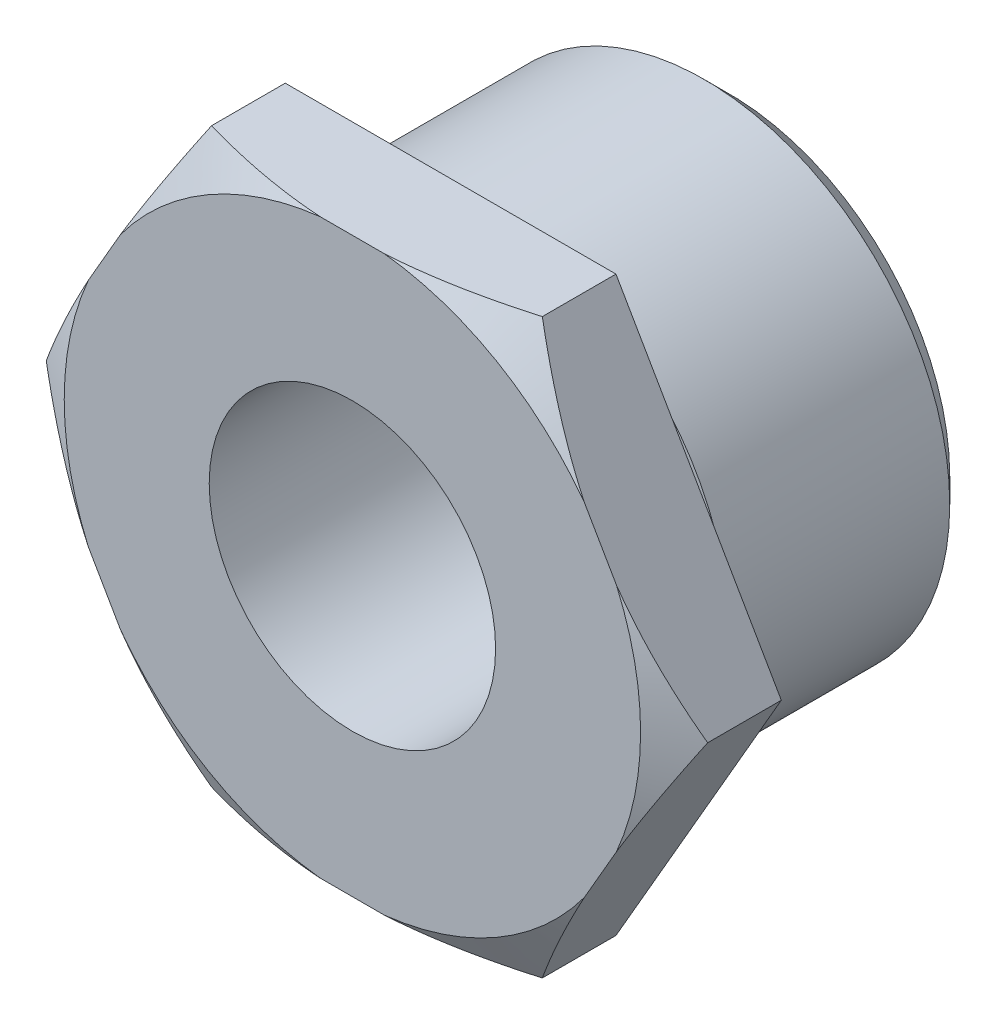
ISO-10303-21;
HEADER;
FILE_DESCRIPTION(('STEP AP214'),'2;1');
FILE_NAME('part.step','',(''),(''),'','','');
FILE_SCHEMA(('AUTOMOTIVE_DESIGN { 1 0 10303 214 1 1 1 1 }'));
ENDSEC;
DATA;
#1=APPLICATION_CONTEXT('core data for automotive mechanical design processes');
#2=APPLICATION_PROTOCOL_DEFINITION('international standard','automotive_design',2000,#1);
#3=PRODUCT_CONTEXT('',#1,'mechanical');
#4=PRODUCT('Part','Part','',(#3));
#5=PRODUCT_RELATED_PRODUCT_CATEGORY('part','',(#4));
#6=PRODUCT_DEFINITION_FORMATION('','',#4);
#7=PRODUCT_DEFINITION_CONTEXT('part definition',#1,'design');
#8=PRODUCT_DEFINITION('design','',#6,#7);
#9=PRODUCT_DEFINITION_SHAPE('','',#8);
#10=(LENGTH_UNIT() NAMED_UNIT(*) SI_UNIT(.MILLI.,.METRE.));
#11=(NAMED_UNIT(*) PLANE_ANGLE_UNIT() SI_UNIT($,.RADIAN.));
#12=(NAMED_UNIT(*) SI_UNIT($,.STERADIAN.) SOLID_ANGLE_UNIT());
#13=UNCERTAINTY_MEASURE_WITH_UNIT(LENGTH_MEASURE(1.E-05),#10,'distance_accuracy_value','');
#14=(GEOMETRIC_REPRESENTATION_CONTEXT(3) GLOBAL_UNCERTAINTY_ASSIGNED_CONTEXT((#13)) GLOBAL_UNIT_ASSIGNED_CONTEXT((#10,
#11,#12)) REPRESENTATION_CONTEXT('',''));
#15=CARTESIAN_POINT('',(0.,0.,0.));
#16=DIRECTION('',(0.,0.,1.));
#17=DIRECTION('',(1.,0.,0.));
#18=AXIS2_PLACEMENT_3D('',#15,#16,#17);
#19=CARTESIAN_POINT('',(-10.1036297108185,17.5,0.));
#20=DIRECTION('',(0.,0.,-1.));
#21=DIRECTION('',(-1.,0.,0.));
#22=AXIS2_PLACEMENT_3D('',#19,#20,#21);
#23=PLANE('',#22);
#24=DIRECTION('',(-0.5,-0.866025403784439,0.));
#25=VECTOR('',#24,1.);
#26=CARTESIAN_POINT('',(-10.1036297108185,17.5,0.));
#27=LINE('',#26,#25);
#28=CARTESIAN_POINT('',(-10.1036297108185,17.5,0.));
#29=VERTEX_POINT('',#28);
#30=CARTESIAN_POINT('',(-20.2072594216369,0.,0.));
#31=VERTEX_POINT('',#30);
#32=EDGE_CURVE('E123',#29,#31,#27,.T.);
#33=ORIENTED_EDGE('',*,*,#32,.F.);
#34=DIRECTION('',(-1.,0.,0.));
#35=VECTOR('',#34,1.);
#36=CARTESIAN_POINT('',(10.1036297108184,17.5,0.));
#37=LINE('',#36,#35);
#38=CARTESIAN_POINT('',(10.1036297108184,17.5,0.));
#39=VERTEX_POINT('',#38);
#40=EDGE_CURVE('E167',#39,#29,#37,.T.);
#41=ORIENTED_EDGE('',*,*,#40,.F.);
#42=DIRECTION('',(-0.5,0.866025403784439,0.));
#43=VECTOR('',#42,1.);
#44=CARTESIAN_POINT('',(20.2072594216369,0.,0.));
#45=LINE('',#44,#43);
#46=CARTESIAN_POINT('',(20.2072594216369,0.,0.));
#47=VERTEX_POINT('',#46);
#48=EDGE_CURVE('E170',#47,#39,#45,.T.);
#49=ORIENTED_EDGE('',*,*,#48,.F.);
#50=DIRECTION('',(0.5,0.866025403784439,0.));
#51=VECTOR('',#50,1.);
#52=CARTESIAN_POINT('',(10.1036297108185,-17.5,0.));
#53=LINE('',#52,#51);
#54=CARTESIAN_POINT('',(10.1036297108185,-17.5,0.));
#55=VERTEX_POINT('',#54);
#56=EDGE_CURVE('E173',#55,#47,#53,.T.);
#57=ORIENTED_EDGE('',*,*,#56,.F.);
#58=DIRECTION('',(1.,0.,0.));
#59=VECTOR('',#58,1.);
#60=CARTESIAN_POINT('',(-10.1036297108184,-17.5,0.));
#61=LINE('',#60,#59);
#62=CARTESIAN_POINT('',(-10.1036297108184,-17.5,0.));
#63=VERTEX_POINT('',#62);
#64=EDGE_CURVE('E176',#63,#55,#61,.T.);
#65=ORIENTED_EDGE('',*,*,#64,.F.);
#66=DIRECTION('',(0.5,-0.866025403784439,0.));
#67=VECTOR('',#66,1.);
#68=CARTESIAN_POINT('',(-20.2072594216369,0.,0.));
#69=LINE('',#68,#67);
#70=EDGE_CURVE('E179',#31,#63,#69,.T.);
#71=ORIENTED_EDGE('',*,*,#70,.F.);
#72=EDGE_LOOP('',(#33,#41,#49,#57,#65,#71));
#73=FACE_BOUND('',#72,.T.);
#74=CARTESIAN_POINT('',(0.,0.,0.));
#75=DIRECTION('',(0.,0.,1.));
#76=DIRECTION('',(1.,0.,0.));
#77=AXIS2_PLACEMENT_3D('',#74,#75,#76);
#78=CIRCLE('',#77,13.5);
#79=CARTESIAN_POINT('',(13.5,0.,0.));
#80=VERTEX_POINT('',#79);
#81=EDGE_CURVE('E255',#80,#80,#78,.T.);
#82=ORIENTED_EDGE('',*,*,#81,.T.);
#83=EDGE_LOOP('',(#82));
#84=FACE_BOUND('',#83,.T.);
#85=ADVANCED_FACE('F24',(#73,#84),#23,.T.);
#86=CARTESIAN_POINT('',(-10.1036297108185,17.5,6.));
#87=DIRECTION('',(0.866025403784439,-0.5,0.));
#88=DIRECTION('',(0.5,0.866025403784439,0.));
#89=AXIS2_PLACEMENT_3D('',#86,#87,#88);
#90=PLANE('',#89);
#91=DIRECTION('',(0.,0.,-1.));
#92=VECTOR('',#91,1.);
#93=CARTESIAN_POINT('',(-20.2072594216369,0.,6.));
#94=LINE('',#93,#92);
#95=CARTESIAN_POINT('',(-20.2072594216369,0.,4.5));
#96=VERTEX_POINT('',#95);
#97=EDGE_CURVE('E131',#96,#31,#94,.T.);
#98=ORIENTED_EDGE('',*,*,#97,.F.);
#99=CARTESIAN_POINT('',(-20.58633056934,-0.656570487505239,4.27509975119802));
#100=CARTESIAN_POINT('',(-20.3531796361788,-0.252741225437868,4.41705331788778));
#101=CARTESIAN_POINT('',(-20.1190873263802,0.152718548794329,4.55302058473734));
#102=CARTESIAN_POINT('',(-19.6488932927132,0.967118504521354,4.81115721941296));
#103=CARTESIAN_POINT('',(-19.4127906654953,1.37606025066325,4.93331998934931));
#104=CARTESIAN_POINT('',(-18.9379290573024,2.19854468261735,5.1622414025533));
#105=CARTESIAN_POINT('',(-18.6991640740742,2.61209776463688,5.26895062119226));
#106=CARTESIAN_POINT('',(-18.2198521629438,3.44229034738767,5.46446469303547));
#107=CARTESIAN_POINT('',(-17.979305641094,3.85892914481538,5.5532735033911));
#108=CARTESIAN_POINT('',(-17.4978479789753,4.69283827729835,5.71064164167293));
#109=CARTESIAN_POINT('',(-17.2569453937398,5.11009379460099,5.77930490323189));
#110=CARTESIAN_POINT('',(-16.7738311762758,5.94687216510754,5.89529137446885));
#111=CARTESIAN_POINT('',(-16.531619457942,6.36639516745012,5.94261316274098));
#112=CARTESIAN_POINT('',(-16.0467259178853,7.20625541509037,6.01454592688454));
#113=CARTESIAN_POINT('',(-15.8040453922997,7.62659041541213,6.03919172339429));
#114=CARTESIAN_POINT('',(-15.3184039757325,8.46774602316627,6.06516470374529));
#115=CARTESIAN_POINT('',(-15.07544315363,8.88856651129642,6.0664967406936));
#116=CARTESIAN_POINT('',(-14.7780435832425,9.40367767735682,6.05384021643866));
#117=CARTESIAN_POINT('',(-14.7234569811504,9.49822444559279,6.05092706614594));
#118=CARTESIAN_POINT('',(-14.6143029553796,9.68728476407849,6.04392870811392));
#119=CARTESIAN_POINT('',(-14.5597355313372,9.78179831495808,6.03984352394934));
#120=CARTESIAN_POINT('',(-14.3960829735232,10.0652528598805,6.02583886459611));
#121=CARTESIAN_POINT('',(-14.2870348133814,10.2541298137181,6.01416973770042));
#122=CARTESIAN_POINT('',(-14.0056541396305,10.7414954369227,5.97809935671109));
#123=CARTESIAN_POINT('',(-13.8334297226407,11.039796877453,5.95024064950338));
#124=CARTESIAN_POINT('',(-13.4895162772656,11.6354724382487,5.88340799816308));
#125=CARTESIAN_POINT('',(-13.3178272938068,11.932846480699,5.84443314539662));
#126=CARTESIAN_POINT('',(-12.8036745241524,12.8233852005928,5.71156705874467));
#127=CARTESIAN_POINT('',(-12.4622163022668,13.4148081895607,5.60174649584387));
#128=CARTESIAN_POINT('',(-11.7822674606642,14.5925141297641,5.34463526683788));
#129=CARTESIAN_POINT('',(-11.4437835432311,15.1787854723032,5.1972752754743));
#130=CARTESIAN_POINT('',(-10.7707318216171,16.3445452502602,4.87095028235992));
#131=CARTESIAN_POINT('',(-10.4361634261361,16.9240347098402,4.69199012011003));
#132=CARTESIAN_POINT('',(-9.87797967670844,17.8908373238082,4.36971974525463));
#133=CARTESIAN_POINT('',(-9.65332733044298,18.2799466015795,4.23348593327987));
#134=CARTESIAN_POINT('',(-9.20629672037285,19.0542263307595,3.95082475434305));
#135=CARTESIAN_POINT('',(-8.98391395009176,19.4394045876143,3.80442594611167));
#136=CARTESIAN_POINT('',(-8.76231373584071,19.8232274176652,3.65349377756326));
#137=B_SPLINE_CURVE_WITH_KNOTS('',3,(#99,#100,#101,#102,#103,#104,#105,#106,#107,#108,#109,#110,
#111,#112,#113,#114,#115,#116,#117,#118,#119,#120,#121,#122,#123,#124,#125,#126,#127,#128,#129,
#130,#131,#132,#133,#134,#135,#136),.UNSPECIFIED.,.F.,.F.,(4,2,2,2,2,2,2,2,2,2,2,2,2,2,2,2,2,2,
4),(0.,1.46233657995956,2.92536915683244,4.39298219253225,5.86027043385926,7.31984996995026,
8.77952670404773,10.2369582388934,11.6940863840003,12.021720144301,12.3493473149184,
13.0045252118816,14.0410409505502,15.0776414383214,17.1513909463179,19.2289982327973,
21.30628761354,22.71467992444,24.1192640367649),.UNSPECIFIED.);
#138=CARTESIAN_POINT('',(-16.1343895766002,7.05441750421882,6.));
#139=VERTEX_POINT('',#138);
#140=EDGE_CURVE('E114',#96,#139,#137,.T.);
#141=ORIENTED_EDGE('',*,*,#140,.T.);
#142=DIRECTION('',(-0.5,-0.866025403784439,0.));
#143=VECTOR('',#142,1.);
#144=CARTESIAN_POINT('',(-10.1036297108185,17.5,6.));
#145=LINE('',#144,#143);
#146=CARTESIAN_POINT('',(-14.1764995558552,10.4455824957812,6.));
#147=VERTEX_POINT('',#146);
#148=EDGE_CURVE('E165',#147,#139,#145,.T.);
#149=ORIENTED_EDGE('',*,*,#148,.F.);
#150=CARTESIAN_POINT('',(-10.1036297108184,17.5,4.5));
#151=VERTEX_POINT('',#150);
#152=EDGE_CURVE('E125',#147,#151,#137,.T.);
#153=ORIENTED_EDGE('',*,*,#152,.T.);
#154=DIRECTION('',(0.,0.,-1.));
#155=VECTOR('',#154,1.);
#156=CARTESIAN_POINT('',(-10.1036297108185,17.5,6.));
#157=LINE('',#156,#155);
#158=EDGE_CURVE('E150',#151,#29,#157,.T.);
#159=ORIENTED_EDGE('',*,*,#158,.T.);
#160=ORIENTED_EDGE('',*,*,#32,.T.);
#161=EDGE_LOOP('',(#98,#141,#149,#153,#159,#160));
#162=FACE_BOUND('',#161,.T.);
#163=ADVANCED_FACE('F26',(#162),#90,.F.);
#164=CARTESIAN_POINT('',(-20.2072594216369,0.,6.));
#165=DIRECTION('',(0.866025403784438,0.5,0.));
#166=DIRECTION('',(-0.5,0.866025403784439,0.));
#167=AXIS2_PLACEMENT_3D('',#164,#165,#166);
#168=PLANE('',#167);
#169=DIRECTION('',(0.,0.,-1.));
#170=VECTOR('',#169,1.);
#171=CARTESIAN_POINT('',(-10.1036297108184,-17.5,6.));
#172=LINE('',#171,#170);
#173=CARTESIAN_POINT('',(-10.1036297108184,-17.5,4.5));
#174=VERTEX_POINT('',#173);
#175=EDGE_CURVE('E140',#174,#63,#172,.T.);
#176=ORIENTED_EDGE('',*,*,#175,.F.);
#177=CARTESIAN_POINT('',(-8.7623137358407,-19.8232274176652,3.65349377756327));
#178=CARTESIAN_POINT('',(-9.00714381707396,-19.399169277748,3.82023789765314));
#179=CARTESIAN_POINT('',(-9.25294160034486,-18.973435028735,3.98147021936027));
#180=CARTESIAN_POINT('',(-9.7466647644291,-18.1182814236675,4.29096488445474));
#181=CARTESIAN_POINT('',(-9.99459089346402,-17.6888607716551,4.43922244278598));
#182=CARTESIAN_POINT('',(-10.4935779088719,-16.8245899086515,4.72125796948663));
#183=CARTESIAN_POINT('',(-10.7446473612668,-16.3897248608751,4.85497573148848));
#184=CARTESIAN_POINT('',(-11.2489357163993,-15.5162718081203,5.10493348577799));
#185=CARTESIAN_POINT('',(-11.5021543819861,-15.0776842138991,5.22117538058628));
#186=CARTESIAN_POINT('',(-12.0096853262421,-14.1986148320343,5.43337963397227));
#187=CARTESIAN_POINT('',(-12.2639894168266,-13.7581472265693,5.52941976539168));
#188=CARTESIAN_POINT('',(-12.7744660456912,-12.8739757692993,5.69945726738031));
#189=CARTESIAN_POINT('',(-13.0306386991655,-12.4302717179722,5.77345326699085));
#190=CARTESIAN_POINT('',(-13.5439885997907,-11.5411236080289,5.89720349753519));
#191=CARTESIAN_POINT('',(-13.8011632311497,-11.0956840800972,5.94700084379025));
#192=CARTESIAN_POINT('',(-14.3163997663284,-10.2032682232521,6.02098022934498));
#193=CARTESIAN_POINT('',(-14.5744614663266,-9.75629224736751,6.04516780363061));
#194=CARTESIAN_POINT('',(-14.9410350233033,-9.12136822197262,6.06078026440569));
#195=CARTESIAN_POINT('',(-15.0494522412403,-8.93358409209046,6.06307148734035));
#196=CARTESIAN_POINT('',(-15.2662887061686,-8.55801231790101,6.06300164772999));
#197=CARTESIAN_POINT('',(-15.3747079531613,-8.37022467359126,6.06064050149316));
#198=CARTESIAN_POINT('',(-15.699838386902,-7.80708224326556,6.04658789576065));
#199=CARTESIAN_POINT('',(-15.9164850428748,-7.43183922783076,6.02792993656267));
#200=CARTESIAN_POINT('',(-16.3053276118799,-6.75834414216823,5.97809030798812));
#201=CARTESIAN_POINT('',(-16.4776332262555,-6.45990206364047,5.95021335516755));
#202=CARTESIAN_POINT('',(-16.8217073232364,-5.86394824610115,5.88333650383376));
#203=CARTESIAN_POINT('',(-16.9934757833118,-5.5664365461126,5.84433614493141));
#204=CARTESIAN_POINT('',(-17.5078584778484,-4.67549958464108,5.71138071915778));
#205=CARTESIAN_POINT('',(-17.8494648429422,-4.08382000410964,5.60148267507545));
#206=CARTESIAN_POINT('',(-18.5294060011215,-2.90612737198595,5.34430282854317));
#207=CARTESIAN_POINT('',(-18.8677372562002,-2.32012044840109,5.19698445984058));
#208=CARTESIAN_POINT('',(-19.5404822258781,-1.15489198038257,4.8707772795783));
#209=CARTESIAN_POINT('',(-19.8748966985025,-0.575669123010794,4.69189468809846));
#210=CARTESIAN_POINT('',(-20.2706964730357,0.109876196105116,4.46337365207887));
#211=CARTESIAN_POINT('',(-20.3339478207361,0.219430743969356,4.42633957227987));
#212=CARTESIAN_POINT('',(-20.460264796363,0.438218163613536,4.35138377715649));
#213=CARTESIAN_POINT('',(-20.5233305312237,0.547451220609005,4.31346278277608));
#214=CARTESIAN_POINT('',(-20.58633056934,0.656570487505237,4.27509975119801));
#215=B_SPLINE_CURVE_WITH_KNOTS('',3,(#177,#178,#179,#180,#181,#182,#183,#184,#185,#186,#187,
#188,#189,#190,#191,#192,#193,#194,#195,#196,#197,#198,#199,#200,#201,#202,#203,#204,#205,#206,
#207,#208,#209,#210,#211,#212,#213,#214),.UNSPECIFIED.,.F.,.F.,(4,2,2,2,2,2,2,2,2,2,2,2,2,2,2,2,
2,2,4),(0.,1.55186666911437,3.10430327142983,4.66294128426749,6.22140949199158,7.77376341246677,
9.32621385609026,10.8758880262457,12.4252272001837,13.075726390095,13.7262372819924,
15.0268826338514,16.063915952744,17.1009921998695,19.1756560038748,21.2523549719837,
23.3286451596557,23.7240815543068,24.1192069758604),.UNSPECIFIED.);
#216=CARTESIAN_POINT('',(-14.1764995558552,-10.4455824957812,6.));
#217=VERTEX_POINT('',#216);
#218=EDGE_CURVE('E136',#174,#217,#215,.T.);
#219=ORIENTED_EDGE('',*,*,#218,.T.);
#220=DIRECTION('',(0.5,-0.866025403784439,0.));
#221=VECTOR('',#220,1.);
#222=CARTESIAN_POINT('',(-20.2072594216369,0.,6.));
#223=LINE('',#222,#221);
#224=CARTESIAN_POINT('',(-16.1343895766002,-7.05441750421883,6.));
#225=VERTEX_POINT('',#224);
#226=EDGE_CURVE('E135',#225,#217,#223,.T.);
#227=ORIENTED_EDGE('',*,*,#226,.F.);
#228=EDGE_CURVE('E117',#225,#96,#215,.T.);
#229=ORIENTED_EDGE('',*,*,#228,.T.);
#230=ORIENTED_EDGE('',*,*,#97,.T.);
#231=ORIENTED_EDGE('',*,*,#70,.T.);
#232=EDGE_LOOP('',(#176,#219,#227,#229,#230,#231));
#233=FACE_BOUND('',#232,.T.);
#234=ADVANCED_FACE('F129',(#233),#168,.F.);
#235=CARTESIAN_POINT('',(-10.1036297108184,-17.5,6.));
#236=DIRECTION('',(0.,1.,0.));
#237=DIRECTION('',(-1.,0.,0.));
#238=AXIS2_PLACEMENT_3D('',#235,#236,#237);
#239=PLANE('',#238);
#240=DIRECTION('',(0.,0.,-1.));
#241=VECTOR('',#240,1.);
#242=CARTESIAN_POINT('',(10.1036297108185,-17.5,6.));
#243=LINE('',#242,#241);
#244=CARTESIAN_POINT('',(10.1036297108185,-17.5,4.5));
#245=VERTEX_POINT('',#244);
#246=EDGE_CURVE('E142',#245,#55,#243,.T.);
#247=ORIENTED_EDGE('',*,*,#246,.F.);
#248=CARTESIAN_POINT('',(-26.8050592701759,-17.5,-2.3154075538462));
#249=CARTESIAN_POINT('',(-26.4208649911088,-17.5,-2.12967562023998));
#250=CARTESIAN_POINT('',(-26.0362065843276,-17.5,-1.94490422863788));
#251=CARTESIAN_POINT('',(-25.2658634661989,-17.5,-1.57750298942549));
#252=CARTESIAN_POINT('',(-24.8801787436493,-17.5,-1.39487316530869));
#253=CARTESIAN_POINT('',(-23.7213252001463,-17.5,-0.850473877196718));
#254=CARTESIAN_POINT('',(-22.9464817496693,-17.5,-0.492255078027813));
#255=CARTESIAN_POINT('',(-21.3870139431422,-17.5,0.214451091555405));
#256=CARTESIAN_POINT('',(-20.6023589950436,-17.5,0.562871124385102));
#257=CARTESIAN_POINT('',(-19.0266039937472,-17.5,1.24476425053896));
#258=CARTESIAN_POINT('',(-18.2355042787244,-17.5,1.57823812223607));
#259=CARTESIAN_POINT('',(-16.6357403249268,-17.5,2.23023092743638));
#260=CARTESIAN_POINT('',(-15.8269797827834,-17.5,2.54851480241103));
#261=CARTESIAN_POINT('',(-14.1999167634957,-17.5,3.16017758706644));
#262=CARTESIAN_POINT('',(-13.3816132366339,-17.5,3.45355372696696));
#263=CARTESIAN_POINT('',(-11.735867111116,-17.5,4.00752051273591));
#264=CARTESIAN_POINT('',(-10.9084481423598,-17.5,4.26818078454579));
#265=CARTESIAN_POINT('',(-9.24176728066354,-17.5,4.74826895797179));
#266=CARTESIAN_POINT('',(-8.40250922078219,-17.5,4.96770988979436));
#267=CARTESIAN_POINT('',(-7.1345838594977,-17.5,5.25792756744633));
#268=CARTESIAN_POINT('',(-6.7103476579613,-17.5,5.34819070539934));
#269=CARTESIAN_POINT('',(-5.85904966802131,-17.5,5.51431164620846));
#270=CARTESIAN_POINT('',(-5.43198794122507,-17.5,5.59016976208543));
#271=CARTESIAN_POINT('',(-4.5753164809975,-17.5,5.72613760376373));
#272=CARTESIAN_POINT('',(-4.14570654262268,-17.5,5.78624604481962));
#273=CARTESIAN_POINT('',(-3.28445659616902,-17.5,5.88950333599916));
#274=CARTESIAN_POINT('',(-2.85281667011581,-17.5,5.93265286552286));
#275=CARTESIAN_POINT('',(-1.99085543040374,-17.5,6.00083445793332));
#276=CARTESIAN_POINT('',(-1.56054313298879,-17.5,6.02597976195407));
#277=CARTESIAN_POINT('',(-0.69924074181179,-17.5,6.05801923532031));
#278=CARTESIAN_POINT('',(-0.268250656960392,-17.5,6.06491364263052));
#279=CARTESIAN_POINT('',(0.593511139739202,-17.5,6.06028771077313));
#280=CARTESIAN_POINT('',(1.02428287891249,-17.5,6.04877255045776));
#281=CARTESIAN_POINT('',(1.88496527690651,-17.5,6.00761389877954));
#282=CARTESIAN_POINT('',(2.31487589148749,-17.5,5.97796949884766));
#283=CARTESIAN_POINT('',(3.35656616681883,-17.5,5.88479435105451));
#284=CARTESIAN_POINT('',(3.96754806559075,-17.5,5.81219590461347));
#285=CARTESIAN_POINT('',(5.18483582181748,-17.5,5.63441013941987));
#286=CARTESIAN_POINT('',(5.79114035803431,-17.5,5.52921393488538));
#287=CARTESIAN_POINT('',(6.99857131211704,-17.5,5.28996340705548));
#288=CARTESIAN_POINT('',(7.599692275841,-17.5,5.15588181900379));
#289=CARTESIAN_POINT('',(8.79575221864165,-17.5,4.86295248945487));
#290=CARTESIAN_POINT('',(9.39069177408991,-17.5,4.70410707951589));
#291=CARTESIAN_POINT('',(10.5890545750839,-17.5,4.36129337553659));
#292=CARTESIAN_POINT('',(11.1923278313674,-17.5,4.17680430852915));
#293=CARTESIAN_POINT('',(12.3924967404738,-17.5,3.78958454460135));
#294=CARTESIAN_POINT('',(12.9893964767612,-17.5,3.58686642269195));
#295=CARTESIAN_POINT('',(14.1744289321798,-17.5,3.16735170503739));
#296=CARTESIAN_POINT('',(14.7625920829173,-17.5,2.950640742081));
#297=CARTESIAN_POINT('',(15.6413484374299,-17.5,2.61610280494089));
#298=CARTESIAN_POINT('',(15.9337483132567,-17.5,2.50298623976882));
#299=CARTESIAN_POINT('',(16.5174103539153,-17.5,2.27387357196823));
#300=CARTESIAN_POINT('',(16.8086725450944,-17.5,2.15787753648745));
#301=CARTESIAN_POINT('',(17.0994067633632,-17.5,2.04057129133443));
#302=B_SPLINE_CURVE_WITH_KNOTS('',3,(#248,#249,#250,#251,#252,#253,#254,#255,#256,#257,#258,
#259,#260,#261,#262,#263,#264,#265,#266,#267,#268,#269,#270,#271,#272,#273,#274,#275,#276,#277,
#278,#279,#280,#281,#282,#283,#284,#285,#286,#287,#288,#289,#290,#291,#292,#293,#294,#295,#296,
#297,#298,#299,#300,#301),.UNSPECIFIED.,.F.,.F.,(4,2,2,2,2,2,2,2,2,2,2,2,2,2,2,2,2,2,2,2,2,2,2,
2,2,2,4),(0.,1.28019841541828,2.56041086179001,5.12125163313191,7.69673179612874,
10.2720776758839,12.8791738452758,15.4865595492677,18.0882985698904,20.68921374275,
21.9902056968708,23.2911693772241,24.5922391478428,25.8932567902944,27.1860177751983,
28.4787619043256,29.7711424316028,31.0635877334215,32.9083997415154,34.7537150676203,
36.6007798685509,38.4476708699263,40.3398756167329,42.230784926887,44.111054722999,
45.051594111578,45.9921115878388),.UNSPECIFIED.);
#303=CARTESIAN_POINT('',(1.95789002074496,-17.5,6.));
#304=VERTEX_POINT('',#303);
#305=EDGE_CURVE('E187',#245,#304,#302,.F.);
#306=ORIENTED_EDGE('',*,*,#305,.T.);
#307=DIRECTION('',(1.,0.,0.));
#308=VECTOR('',#307,1.);
#309=CARTESIAN_POINT('',(-10.1036297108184,-17.5,6.));
#310=LINE('',#309,#308);
#311=CARTESIAN_POINT('',(-1.95789002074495,-17.5,6.));
#312=VERTEX_POINT('',#311);
#313=EDGE_CURVE('E161',#312,#304,#310,.T.);
#314=ORIENTED_EDGE('',*,*,#313,.F.);
#315=EDGE_CURVE('E186',#312,#174,#302,.F.);
#316=ORIENTED_EDGE('',*,*,#315,.T.);
#317=ORIENTED_EDGE('',*,*,#175,.T.);
#318=ORIENTED_EDGE('',*,*,#64,.T.);
#319=EDGE_LOOP('',(#247,#306,#314,#316,#317,#318));
#320=FACE_BOUND('',#319,.T.);
#321=ADVANCED_FACE('F236',(#320),#239,.F.);
#322=CARTESIAN_POINT('',(10.1036297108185,-17.5,6.));
#323=DIRECTION('',(-0.866025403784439,0.5,0.));
#324=DIRECTION('',(-0.5,-0.866025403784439,0.));
#325=AXIS2_PLACEMENT_3D('',#322,#323,#324);
#326=PLANE('',#325);
#327=DIRECTION('',(0.,0.,-1.));
#328=VECTOR('',#327,1.);
#329=CARTESIAN_POINT('',(20.2072594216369,0.,6.));
#330=LINE('',#329,#328);
#331=CARTESIAN_POINT('',(20.2072594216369,0.,4.5));
#332=VERTEX_POINT('',#331);
#333=EDGE_CURVE('E146',#332,#47,#330,.T.);
#334=ORIENTED_EDGE('',*,*,#333,.F.);
#335=CARTESIAN_POINT('',(20.58633056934,0.656570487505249,4.27509975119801));
#336=CARTESIAN_POINT('',(20.3531796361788,0.252741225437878,4.41705331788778));
#337=CARTESIAN_POINT('',(20.1190873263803,-0.152718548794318,4.55302058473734));
#338=CARTESIAN_POINT('',(19.6488932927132,-0.967118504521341,4.81115721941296));
#339=CARTESIAN_POINT('',(19.4127906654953,-1.37606025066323,4.93331998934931));
#340=CARTESIAN_POINT('',(18.9379290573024,-2.19854468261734,5.1622414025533));
#341=CARTESIAN_POINT('',(18.6991640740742,-2.61209776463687,5.26895062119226));
#342=CARTESIAN_POINT('',(18.2198521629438,-3.44229034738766,5.46446469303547));
#343=CARTESIAN_POINT('',(17.9793056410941,-3.85892914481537,5.5532735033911));
#344=CARTESIAN_POINT('',(17.4978479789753,-4.69283827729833,5.71064164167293));
#345=CARTESIAN_POINT('',(17.2569453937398,-5.11009379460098,5.77930490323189));
#346=CARTESIAN_POINT('',(16.7738311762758,-5.94687216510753,5.89529137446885));
#347=CARTESIAN_POINT('',(16.5316194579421,-6.3663951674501,5.94261316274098));
#348=CARTESIAN_POINT('',(16.0467259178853,-7.20625541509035,6.01454592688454));
#349=CARTESIAN_POINT('',(15.8040453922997,-7.62659041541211,6.03919172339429));
#350=CARTESIAN_POINT('',(15.3184039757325,-8.46774602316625,6.06516470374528));
#351=CARTESIAN_POINT('',(15.07544315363,-8.8885665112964,6.06649674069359));
#352=CARTESIAN_POINT('',(14.7780435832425,-9.40367767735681,6.05384021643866));
#353=CARTESIAN_POINT('',(14.7234569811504,-9.49822444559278,6.05092706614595));
#354=CARTESIAN_POINT('',(14.6143029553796,-9.68728476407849,6.04392870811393));
#355=CARTESIAN_POINT('',(14.5597355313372,-9.78179831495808,6.03984352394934));
#356=CARTESIAN_POINT('',(14.3960829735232,-10.0652528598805,6.02583886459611));
#357=CARTESIAN_POINT('',(14.2870348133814,-10.2541298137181,6.01416973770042));
#358=CARTESIAN_POINT('',(14.0056541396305,-10.7414954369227,5.9780993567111));
#359=CARTESIAN_POINT('',(13.8334297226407,-11.039796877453,5.95024064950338));
#360=CARTESIAN_POINT('',(13.4895162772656,-11.6354724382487,5.88340799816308));
#361=CARTESIAN_POINT('',(13.3178272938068,-11.932846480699,5.84443314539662));
#362=CARTESIAN_POINT('',(12.8036745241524,-12.8233852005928,5.71156705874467));
#363=CARTESIAN_POINT('',(12.4622163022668,-13.4148081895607,5.60174649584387));
#364=CARTESIAN_POINT('',(11.7822674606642,-14.5925141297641,5.34463526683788));
#365=CARTESIAN_POINT('',(11.4437835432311,-15.1787854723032,5.1972752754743));
#366=CARTESIAN_POINT('',(10.7707318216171,-16.3445452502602,4.87095028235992));
#367=CARTESIAN_POINT('',(10.4361634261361,-16.9240347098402,4.69199012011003));
#368=CARTESIAN_POINT('',(9.87797967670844,-17.8908373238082,4.36971974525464));
#369=CARTESIAN_POINT('',(9.65332733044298,-18.2799466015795,4.23348593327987));
#370=CARTESIAN_POINT('',(9.20629672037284,-19.0542263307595,3.95082475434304));
#371=CARTESIAN_POINT('',(8.98391395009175,-19.4394045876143,3.80442594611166));
#372=CARTESIAN_POINT('',(8.7623137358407,-19.8232274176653,3.65349377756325));
#373=B_SPLINE_CURVE_WITH_KNOTS('',3,(#335,#336,#337,#338,#339,#340,#341,#342,#343,#344,#345,
#346,#347,#348,#349,#350,#351,#352,#353,#354,#355,#356,#357,#358,#359,#360,#361,#362,#363,#364,
#365,#366,#367,#368,#369,#370,#371,#372),.UNSPECIFIED.,.F.,.F.,(4,2,2,2,2,2,2,2,2,2,2,2,2,2,2,2,
2,2,4),(0.,1.46233657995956,2.92536915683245,4.39298219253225,5.86027043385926,7.31984996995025,
8.77952670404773,10.2369582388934,11.6940863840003,12.021720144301,12.3493473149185,
13.0045252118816,14.0410409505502,15.0776414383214,17.1513909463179,19.2289982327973,
21.30628761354,22.71467992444,24.1192640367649),.UNSPECIFIED.);
#374=CARTESIAN_POINT('',(16.1343895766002,-7.0544175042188,6.));
#375=VERTEX_POINT('',#374);
#376=EDGE_CURVE('E225',#332,#375,#373,.T.);
#377=ORIENTED_EDGE('',*,*,#376,.T.);
#378=DIRECTION('',(0.5,0.866025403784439,0.));
#379=VECTOR('',#378,1.);
#380=CARTESIAN_POINT('',(10.1036297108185,-17.5,6.));
#381=LINE('',#380,#379);
#382=CARTESIAN_POINT('',(14.1764995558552,-10.4455824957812,6.));
#383=VERTEX_POINT('',#382);
#384=EDGE_CURVE('E158',#383,#375,#381,.T.);
#385=ORIENTED_EDGE('',*,*,#384,.F.);
#386=EDGE_CURVE('E231',#383,#245,#373,.T.);
#387=ORIENTED_EDGE('',*,*,#386,.T.);
#388=ORIENTED_EDGE('',*,*,#246,.T.);
#389=ORIENTED_EDGE('',*,*,#56,.T.);
#390=EDGE_LOOP('',(#334,#377,#385,#387,#388,#389));
#391=FACE_BOUND('',#390,.T.);
#392=ADVANCED_FACE('F232',(#391),#326,.F.);
#393=CARTESIAN_POINT('',(20.2072594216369,0.,6.));
#394=DIRECTION('',(-0.866025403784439,-0.5,0.));
#395=DIRECTION('',(0.5,-0.866025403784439,0.));
#396=AXIS2_PLACEMENT_3D('',#393,#394,#395);
#397=PLANE('',#396);
#398=DIRECTION('',(0.,0.,-1.));
#399=VECTOR('',#398,1.);
#400=CARTESIAN_POINT('',(10.1036297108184,17.5,6.));
#401=LINE('',#400,#399);
#402=CARTESIAN_POINT('',(10.1036297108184,17.5,4.5));
#403=VERTEX_POINT('',#402);
#404=EDGE_CURVE('E148',#403,#39,#401,.T.);
#405=ORIENTED_EDGE('',*,*,#404,.F.);
#406=CARTESIAN_POINT('',(8.7623137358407,19.8232274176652,3.65349377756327));
#407=CARTESIAN_POINT('',(9.00714381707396,19.399169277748,3.82023789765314));
#408=CARTESIAN_POINT('',(9.25294160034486,18.973435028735,3.98147021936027));
#409=CARTESIAN_POINT('',(9.7466647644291,18.1182814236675,4.29096488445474));
#410=CARTESIAN_POINT('',(9.99459089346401,17.6888607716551,4.43922244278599));
#411=CARTESIAN_POINT('',(10.4935779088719,16.8245899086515,4.72125796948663));
#412=CARTESIAN_POINT('',(10.7446473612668,16.3897248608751,4.85497573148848));
#413=CARTESIAN_POINT('',(11.2489357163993,15.5162718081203,5.10493348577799));
#414=CARTESIAN_POINT('',(11.5021543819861,15.0776842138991,5.22117538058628));
#415=CARTESIAN_POINT('',(12.0096853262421,14.1986148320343,5.43337963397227));
#416=CARTESIAN_POINT('',(12.2639894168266,13.7581472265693,5.52941976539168));
#417=CARTESIAN_POINT('',(12.7744660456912,12.8739757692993,5.69945726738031));
#418=CARTESIAN_POINT('',(13.0306386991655,12.4302717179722,5.77345326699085));
#419=CARTESIAN_POINT('',(13.5439885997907,11.5411236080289,5.89720349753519));
#420=CARTESIAN_POINT('',(13.8011632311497,11.0956840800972,5.94700084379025));
#421=CARTESIAN_POINT('',(14.3163997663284,10.2032682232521,6.02098022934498));
#422=CARTESIAN_POINT('',(14.5744614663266,9.75629224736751,6.04516780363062));
#423=CARTESIAN_POINT('',(14.9410350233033,9.12136822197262,6.0607802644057));
#424=CARTESIAN_POINT('',(15.0494522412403,8.93358409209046,6.06307148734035));
#425=CARTESIAN_POINT('',(15.2662887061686,8.55801231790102,6.06300164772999));
#426=CARTESIAN_POINT('',(15.3747079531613,8.37022467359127,6.06064050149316));
#427=CARTESIAN_POINT('',(15.699838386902,7.80708224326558,6.04658789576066));
#428=CARTESIAN_POINT('',(15.9164850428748,7.43183922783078,6.02792993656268));
#429=CARTESIAN_POINT('',(16.3053276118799,6.75834414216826,5.97809030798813));
#430=CARTESIAN_POINT('',(16.4776332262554,6.4599020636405,5.95021335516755));
#431=CARTESIAN_POINT('',(16.8217073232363,5.86394824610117,5.88333650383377));
#432=CARTESIAN_POINT('',(16.9934757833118,5.56643654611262,5.84433614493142));
#433=CARTESIAN_POINT('',(17.5078584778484,4.6754995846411,5.71138071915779));
#434=CARTESIAN_POINT('',(17.8494648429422,4.08382000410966,5.60148267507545));
#435=CARTESIAN_POINT('',(18.5294060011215,2.90612737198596,5.34430282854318));
#436=CARTESIAN_POINT('',(18.8677372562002,2.3201204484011,5.19698445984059));
#437=CARTESIAN_POINT('',(19.5404822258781,1.15489198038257,4.87077727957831));
#438=CARTESIAN_POINT('',(19.8748966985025,0.575669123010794,4.69189468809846));
#439=CARTESIAN_POINT('',(20.2706964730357,-0.109876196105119,4.46337365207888));
#440=CARTESIAN_POINT('',(20.3339478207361,-0.219430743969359,4.42633957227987));
#441=CARTESIAN_POINT('',(20.4602647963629,-0.438218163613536,4.35138377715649));
#442=CARTESIAN_POINT('',(20.5233305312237,-0.547451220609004,4.31346278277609));
#443=CARTESIAN_POINT('',(20.58633056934,-0.656570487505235,4.27509975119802));
#444=B_SPLINE_CURVE_WITH_KNOTS('',3,(#406,#407,#408,#409,#410,#411,#412,#413,#414,#415,#416,
#417,#418,#419,#420,#421,#422,#423,#424,#425,#426,#427,#428,#429,#430,#431,#432,#433,#434,#435,
#436,#437,#438,#439,#440,#441,#442,#443),.UNSPECIFIED.,.F.,.F.,(4,2,2,2,2,2,2,2,2,2,2,2,2,2,2,2,
2,2,4),(0.,1.55186666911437,3.10430327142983,4.66294128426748,6.22140949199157,7.77376341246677,
9.32621385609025,10.8758880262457,12.4252272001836,13.075726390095,13.7262372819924,
15.0268826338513,16.0639159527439,17.1009921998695,19.1756560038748,21.2523549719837,
23.3286451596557,23.7240815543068,24.1192069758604),.UNSPECIFIED.);
#445=CARTESIAN_POINT('',(14.1764995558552,10.4455824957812,6.));
#446=VERTEX_POINT('',#445);
#447=EDGE_CURVE('E216',#403,#446,#444,.T.);
#448=ORIENTED_EDGE('',*,*,#447,.T.);
#449=DIRECTION('',(-0.5,0.866025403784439,0.));
#450=VECTOR('',#449,1.);
#451=CARTESIAN_POINT('',(20.2072594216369,0.,6.));
#452=LINE('',#451,#450);
#453=CARTESIAN_POINT('',(16.1343895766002,7.0544175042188,6.));
#454=VERTEX_POINT('',#453);
#455=EDGE_CURVE('E155',#454,#446,#452,.T.);
#456=ORIENTED_EDGE('',*,*,#455,.F.);
#457=EDGE_CURVE('E49',#454,#332,#444,.T.);
#458=ORIENTED_EDGE('',*,*,#457,.T.);
#459=ORIENTED_EDGE('',*,*,#333,.T.);
#460=ORIENTED_EDGE('',*,*,#48,.T.);
#461=EDGE_LOOP('',(#405,#448,#456,#458,#459,#460));
#462=FACE_BOUND('',#461,.T.);
#463=ADVANCED_FACE('F235',(#462),#397,.F.);
#464=CARTESIAN_POINT('',(10.1036297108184,17.5,6.));
#465=DIRECTION('',(0.,-1.,0.));
#466=DIRECTION('',(0.,0.,-1.));
#467=AXIS2_PLACEMENT_3D('',#464,#465,#466);
#468=PLANE('',#467);
#469=ORIENTED_EDGE('',*,*,#158,.F.);
#470=CARTESIAN_POINT('',(-26.8050592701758,17.5,-2.31540755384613));
#471=CARTESIAN_POINT('',(-26.4208649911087,17.5,-2.12967562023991));
#472=CARTESIAN_POINT('',(-26.0362065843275,17.5,-1.94490422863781));
#473=CARTESIAN_POINT('',(-25.2658634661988,17.5,-1.57750298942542));
#474=CARTESIAN_POINT('',(-24.8801787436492,17.5,-1.39487316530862));
#475=CARTESIAN_POINT('',(-23.7213252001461,17.5,-0.850473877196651));
#476=CARTESIAN_POINT('',(-22.9464817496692,17.5,-0.492255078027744));
#477=CARTESIAN_POINT('',(-21.387013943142,17.5,0.214451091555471));
#478=CARTESIAN_POINT('',(-20.6023589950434,17.5,0.562871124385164));
#479=CARTESIAN_POINT('',(-19.026603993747,17.5,1.24476425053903));
#480=CARTESIAN_POINT('',(-18.2355042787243,17.5,1.57823812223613));
#481=CARTESIAN_POINT('',(-16.6357403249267,17.5,2.23023092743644));
#482=CARTESIAN_POINT('',(-15.8269797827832,17.5,2.54851480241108));
#483=CARTESIAN_POINT('',(-14.1999167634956,17.5,3.16017758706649));
#484=CARTESIAN_POINT('',(-13.3816132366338,17.5,3.45355372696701));
#485=CARTESIAN_POINT('',(-11.7358671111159,17.5,4.00752051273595));
#486=CARTESIAN_POINT('',(-10.9084481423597,17.5,4.26818078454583));
#487=CARTESIAN_POINT('',(-9.2417672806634,17.5,4.74826895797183));
#488=CARTESIAN_POINT('',(-8.40250922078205,17.5,4.96770988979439));
#489=CARTESIAN_POINT('',(-7.13458385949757,17.5,5.25792756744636));
#490=CARTESIAN_POINT('',(-6.71034765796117,17.5,5.34819070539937));
#491=CARTESIAN_POINT('',(-5.85904966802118,17.5,5.51431164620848));
#492=CARTESIAN_POINT('',(-5.43198794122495,17.5,5.59016976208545));
#493=CARTESIAN_POINT('',(-4.57531648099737,17.5,5.72613760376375));
#494=CARTESIAN_POINT('',(-4.14570654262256,17.5,5.78624604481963));
#495=CARTESIAN_POINT('',(-3.28445659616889,17.5,5.88950333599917));
#496=CARTESIAN_POINT('',(-2.85281667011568,17.5,5.93265286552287));
#497=CARTESIAN_POINT('',(-1.99085543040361,17.5,6.00083445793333));
#498=CARTESIAN_POINT('',(-1.56054313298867,17.5,6.02597976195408));
#499=CARTESIAN_POINT('',(-0.699240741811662,17.5,6.05801923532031));
#500=CARTESIAN_POINT('',(-0.268250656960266,17.5,6.06491364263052));
#501=CARTESIAN_POINT('',(0.593511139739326,17.5,6.06028771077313));
#502=CARTESIAN_POINT('',(1.02428287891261,17.5,6.04877255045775));
#503=CARTESIAN_POINT('',(1.88496527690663,17.5,6.00761389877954));
#504=CARTESIAN_POINT('',(2.31487589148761,17.5,5.97796949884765));
#505=CARTESIAN_POINT('',(3.35656616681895,17.5,5.8847943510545));
#506=CARTESIAN_POINT('',(3.96754806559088,17.5,5.81219590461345));
#507=CARTESIAN_POINT('',(5.18483582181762,17.5,5.63441013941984));
#508=CARTESIAN_POINT('',(5.79114035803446,17.5,5.52921393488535));
#509=CARTESIAN_POINT('',(6.99857131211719,17.5,5.28996340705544));
#510=CARTESIAN_POINT('',(7.59969227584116,17.5,5.15588181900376));
#511=CARTESIAN_POINT('',(8.79575221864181,17.5,4.86295248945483));
#512=CARTESIAN_POINT('',(9.39069177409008,17.5,4.70410707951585));
#513=CARTESIAN_POINT('',(10.5890545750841,17.5,4.36129337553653));
#514=CARTESIAN_POINT('',(11.1923278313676,17.5,4.17680430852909));
#515=CARTESIAN_POINT('',(12.3924967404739,17.5,3.78958454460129));
#516=CARTESIAN_POINT('',(12.9893964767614,17.5,3.58686642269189));
#517=CARTESIAN_POINT('',(14.17442893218,17.5,3.16735170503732));
#518=CARTESIAN_POINT('',(14.7625920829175,17.5,2.95064074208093));
#519=CARTESIAN_POINT('',(15.6413484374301,17.5,2.61610280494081));
#520=CARTESIAN_POINT('',(15.9337483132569,17.5,2.50298623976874));
#521=CARTESIAN_POINT('',(16.5174103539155,17.5,2.27387357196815));
#522=CARTESIAN_POINT('',(16.8086725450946,17.5,2.15787753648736));
#523=CARTESIAN_POINT('',(17.0994067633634,17.5,2.04057129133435));
#524=B_SPLINE_CURVE_WITH_KNOTS('',3,(#470,#471,#472,#473,#474,#475,#476,#477,#478,#479,#480,
#481,#482,#483,#484,#485,#486,#487,#488,#489,#490,#491,#492,#493,#494,#495,#496,#497,#498,#499,
#500,#501,#502,#503,#504,#505,#506,#507,#508,#509,#510,#511,#512,#513,#514,#515,#516,#517,#518,
#519,#520,#521,#522,#523),.UNSPECIFIED.,.F.,.F.,(4,2,2,2,2,2,2,2,2,2,2,2,2,2,2,2,2,2,2,2,2,2,2,
2,2,2,4),(0.,1.28019841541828,2.56041086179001,5.12125163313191,7.69673179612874,
10.2720776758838,12.8791738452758,15.4865595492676,18.0882985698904,20.68921374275,
21.9902056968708,23.2911693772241,24.5922391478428,25.8932567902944,27.1860177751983,
28.4787619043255,29.7711424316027,31.0635877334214,32.9083997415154,34.7537150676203,
36.6007798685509,38.4476708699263,40.3398756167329,42.2307849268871,44.111054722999,
45.051594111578,45.9921115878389),.UNSPECIFIED.);
#525=CARTESIAN_POINT('',(-1.95789002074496,17.5,6.));
#526=VERTEX_POINT('',#525);
#527=EDGE_CURVE('E258',#151,#526,#524,.T.);
#528=ORIENTED_EDGE('',*,*,#527,.T.);
#529=DIRECTION('',(-1.,0.,0.));
#530=VECTOR('',#529,1.);
#531=CARTESIAN_POINT('',(10.1036297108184,17.5,6.));
#532=LINE('',#531,#530);
#533=CARTESIAN_POINT('',(1.95789002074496,17.5,6.));
#534=VERTEX_POINT('',#533);
#535=EDGE_CURVE('E152',#534,#526,#532,.T.);
#536=ORIENTED_EDGE('',*,*,#535,.F.);
#537=EDGE_CURVE('E41',#534,#403,#524,.T.);
#538=ORIENTED_EDGE('',*,*,#537,.T.);
#539=ORIENTED_EDGE('',*,*,#404,.T.);
#540=ORIENTED_EDGE('',*,*,#40,.T.);
#541=EDGE_LOOP('',(#469,#528,#536,#538,#539,#540));
#542=FACE_BOUND('',#541,.T.);
#543=ADVANCED_FACE('F282',(#542),#468,.F.);
#544=CARTESIAN_POINT('',(-10.1036297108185,17.5,6.));
#545=DIRECTION('',(0.,0.,-1.));
#546=DIRECTION('',(-1.,0.,0.));
#547=AXIS2_PLACEMENT_3D('',#544,#545,#546);
#548=PLANE('',#547);
#549=CARTESIAN_POINT('',(0.,0.,6.));
#550=DIRECTION('',(0.,0.,1.));
#551=DIRECTION('',(1.,0.,0.));
#552=AXIS2_PLACEMENT_3D('',#549,#550,#551);
#553=CIRCLE('',#552,8.75);
#554=CARTESIAN_POINT('',(8.75,0.,6.));
#555=VERTEX_POINT('',#554);
#556=EDGE_CURVE('E274',#555,#555,#553,.T.);
#557=ORIENTED_EDGE('',*,*,#556,.F.);
#558=EDGE_LOOP('',(#557));
#559=FACE_BOUND('',#558,.T.);
#560=ORIENTED_EDGE('',*,*,#226,.T.);
#561=CARTESIAN_POINT('',(0.,0.,6.));
#562=DIRECTION('',(0.,0.,-1.));
#563=DIRECTION('',(-1.,0.,0.));
#564=AXIS2_PLACEMENT_3D('',#561,#562,#563);
#565=CIRCLE('',#564,17.6091832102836);
#566=EDGE_CURVE('E11',#217,#312,#565,.F.);
#567=ORIENTED_EDGE('',*,*,#566,.T.);
#568=ORIENTED_EDGE('',*,*,#313,.T.);
#569=EDGE_CURVE('E34',#304,#383,#565,.F.);
#570=ORIENTED_EDGE('',*,*,#569,.T.);
#571=ORIENTED_EDGE('',*,*,#384,.T.);
#572=EDGE_CURVE('E306',#375,#454,#565,.F.);
#573=ORIENTED_EDGE('',*,*,#572,.T.);
#574=ORIENTED_EDGE('',*,*,#455,.T.);
#575=EDGE_CURVE('E308',#446,#534,#565,.F.);
#576=ORIENTED_EDGE('',*,*,#575,.T.);
#577=ORIENTED_EDGE('',*,*,#535,.T.);
#578=EDGE_CURVE('E141',#526,#147,#565,.F.);
#579=ORIENTED_EDGE('',*,*,#578,.T.);
#580=ORIENTED_EDGE('',*,*,#148,.T.);
#581=EDGE_CURVE('E29',#139,#225,#565,.F.);
#582=ORIENTED_EDGE('',*,*,#581,.T.);
#583=EDGE_LOOP('',(#560,#567,#568,#570,#571,#573,#574,#576,#577,#579,#580,#582));
#584=FACE_BOUND('',#583,.T.);
#585=ADVANCED_FACE('F199',(#559,#584),#548,.F.);
#586=CARTESIAN_POINT('',(0.,0.,6.));
#587=DIRECTION('',(0.,0.,-1.));
#588=DIRECTION('',(-1.,0.,0.));
#589=AXIS2_PLACEMENT_3D('',#586,#587,#588);
#590=CONICAL_SURFACE('',#589,17.6091832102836,1.0471975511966);
#591=ORIENTED_EDGE('',*,*,#228,.F.);
#592=ORIENTED_EDGE('',*,*,#581,.F.);
#593=ORIENTED_EDGE('',*,*,#140,.F.);
#594=EDGE_LOOP('',(#591,#592,#593));
#595=FACE_BOUND('',#594,.T.);
#596=ADVANCED_FACE('F116',(#595),#590,.T.);
#597=ORIENTED_EDGE('',*,*,#578,.F.);
#598=ORIENTED_EDGE('',*,*,#527,.F.);
#599=ORIENTED_EDGE('',*,*,#152,.F.);
#600=EDGE_LOOP('',(#597,#598,#599));
#601=FACE_BOUND('',#600,.T.);
#602=ADVANCED_FACE('F198',(#601),#590,.T.);
#603=ORIENTED_EDGE('',*,*,#537,.F.);
#604=ORIENTED_EDGE('',*,*,#575,.F.);
#605=ORIENTED_EDGE('',*,*,#447,.F.);
#606=EDGE_LOOP('',(#603,#604,#605));
#607=FACE_BOUND('',#606,.T.);
#608=ADVANCED_FACE('F201',(#607),#590,.T.);
#609=ORIENTED_EDGE('',*,*,#457,.F.);
#610=ORIENTED_EDGE('',*,*,#572,.F.);
#611=ORIENTED_EDGE('',*,*,#376,.F.);
#612=EDGE_LOOP('',(#609,#610,#611));
#613=FACE_BOUND('',#612,.T.);
#614=ADVANCED_FACE('F307',(#613),#590,.T.);
#615=ORIENTED_EDGE('',*,*,#386,.F.);
#616=ORIENTED_EDGE('',*,*,#569,.F.);
#617=ORIENTED_EDGE('',*,*,#305,.F.);
#618=EDGE_LOOP('',(#615,#616,#617));
#619=FACE_BOUND('',#618,.T.);
#620=ADVANCED_FACE('F314',(#619),#590,.T.);
#621=ORIENTED_EDGE('',*,*,#315,.F.);
#622=ORIENTED_EDGE('',*,*,#566,.F.);
#623=ORIENTED_EDGE('',*,*,#218,.F.);
#624=EDGE_LOOP('',(#621,#622,#623));
#625=FACE_BOUND('',#624,.T.);
#626=ADVANCED_FACE('F200',(#625),#590,.T.);
#627=CARTESIAN_POINT('',(0.,0.,0.));
#628=DIRECTION('',(0.,0.,1.));
#629=DIRECTION('',(1.,0.,0.));
#630=AXIS2_PLACEMENT_3D('',#627,#628,#629);
#631=CYLINDRICAL_SURFACE('',#630,13.5);
#632=ORIENTED_EDGE('',*,*,#81,.F.);
#633=EDGE_LOOP('',(#632));
#634=FACE_BOUND('',#633,.T.);
#635=CARTESIAN_POINT('',(0.,0.,-2.));
#636=DIRECTION('',(0.,0.,1.));
#637=DIRECTION('',(1.,0.,0.));
#638=AXIS2_PLACEMENT_3D('',#635,#636,#637);
#639=CIRCLE('',#638,13.5);
#640=CARTESIAN_POINT('',(13.5,0.,-2.));
#641=VERTEX_POINT('',#640);
#642=EDGE_CURVE('E257',#641,#641,#639,.T.);
#643=ORIENTED_EDGE('',*,*,#642,.T.);
#644=EDGE_LOOP('',(#643));
#645=FACE_BOUND('',#644,.T.);
#646=ADVANCED_FACE('F202',(#634,#645),#631,.T.);
#647=CARTESIAN_POINT('',(0.,13.5,-2.));
#648=DIRECTION('',(0.,0.,-1.));
#649=DIRECTION('',(-1.,0.,0.));
#650=AXIS2_PLACEMENT_3D('',#647,#648,#649);
#651=PLANE('',#650);
#652=ORIENTED_EDGE('',*,*,#642,.F.);
#653=EDGE_LOOP('',(#652));
#654=FACE_BOUND('',#653,.T.);
#655=CARTESIAN_POINT('',(0.,0.,-2.));
#656=DIRECTION('',(0.,0.,1.));
#657=DIRECTION('',(1.,0.,0.));
#658=AXIS2_PLACEMENT_3D('',#655,#656,#657);
#659=CIRCLE('',#658,15.);
#660=CARTESIAN_POINT('',(15.,0.,-2.));
#661=VERTEX_POINT('',#660);
#662=EDGE_CURVE('E260',#661,#661,#659,.T.);
#663=ORIENTED_EDGE('',*,*,#662,.T.);
#664=EDGE_LOOP('',(#663));
#665=FACE_BOUND('',#664,.T.);
#666=ADVANCED_FACE('F375',(#654,#665),#651,.F.);
#667=CARTESIAN_POINT('',(0.,0.,0.));
#668=DIRECTION('',(0.,0.,1.));
#669=DIRECTION('',(1.,0.,0.));
#670=AXIS2_PLACEMENT_3D('',#667,#668,#669);
#671=CYLINDRICAL_SURFACE('',#670,15.);
#672=ORIENTED_EDGE('',*,*,#662,.F.);
#673=EDGE_LOOP('',(#672));
#674=FACE_BOUND('',#673,.T.);
#675=CARTESIAN_POINT('',(0.,0.,-15.5));
#676=DIRECTION('',(0.,0.,1.));
#677=DIRECTION('',(1.,0.,0.));
#678=AXIS2_PLACEMENT_3D('',#675,#676,#677);
#679=CIRCLE('',#678,15.);
#680=CARTESIAN_POINT('',(15.,0.,-15.5));
#681=VERTEX_POINT('',#680);
#682=EDGE_CURVE('E265',#681,#681,#679,.T.);
#683=ORIENTED_EDGE('',*,*,#682,.T.);
#684=EDGE_LOOP('',(#683));
#685=FACE_BOUND('',#684,.T.);
#686=ADVANCED_FACE('F381',(#674,#685),#671,.T.);
#687=CARTESIAN_POINT('',(0.,0.,-17.));
#688=DIRECTION('',(0.,0.,1.));
#689=DIRECTION('',(1.,0.,0.));
#690=AXIS2_PLACEMENT_3D('',#687,#688,#689);
#691=CONICAL_SURFACE('',#690,13.5,0.78539816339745);
#692=ORIENTED_EDGE('',*,*,#682,.F.);
#693=EDGE_LOOP('',(#692));
#694=FACE_BOUND('',#693,.T.);
#695=CARTESIAN_POINT('',(0.,0.,-17.));
#696=DIRECTION('',(0.,0.,1.));
#697=DIRECTION('',(1.,0.,0.));
#698=AXIS2_PLACEMENT_3D('',#695,#696,#697);
#699=CIRCLE('',#698,13.5);
#700=CARTESIAN_POINT('',(13.5,0.,-17.));
#701=VERTEX_POINT('',#700);
#702=EDGE_CURVE('E268',#701,#701,#699,.T.);
#703=ORIENTED_EDGE('',*,*,#702,.T.);
#704=EDGE_LOOP('',(#703));
#705=FACE_BOUND('',#704,.T.);
#706=ADVANCED_FACE('F388',(#694,#705),#691,.T.);
#707=CARTESIAN_POINT('',(0.,13.5,-17.));
#708=DIRECTION('',(0.,0.,1.));
#709=DIRECTION('',(1.,0.,0.));
#710=AXIS2_PLACEMENT_3D('',#707,#708,#709);
#711=PLANE('',#710);
#712=CARTESIAN_POINT('',(0.,0.,-17.));
#713=DIRECTION('',(0.,0.,1.));
#714=DIRECTION('',(1.,0.,0.));
#715=AXIS2_PLACEMENT_3D('',#712,#713,#714);
#716=CIRCLE('',#715,8.75);
#717=CARTESIAN_POINT('',(8.75,0.,-17.));
#718=VERTEX_POINT('',#717);
#719=EDGE_CURVE('E271',#718,#718,#716,.T.);
#720=ORIENTED_EDGE('',*,*,#719,.T.);
#721=EDGE_LOOP('',(#720));
#722=FACE_BOUND('',#721,.T.);
#723=ORIENTED_EDGE('',*,*,#702,.F.);
#724=EDGE_LOOP('',(#723));
#725=FACE_BOUND('',#724,.T.);
#726=ADVANCED_FACE('F396',(#722,#725),#711,.F.);
#727=CARTESIAN_POINT('',(0.,0.,-17.));
#728=DIRECTION('',(0.,0.,1.));
#729=DIRECTION('',(1.,0.,0.));
#730=AXIS2_PLACEMENT_3D('',#727,#728,#729);
#731=CYLINDRICAL_SURFACE('',#730,8.75);
#732=ORIENTED_EDGE('',*,*,#719,.F.);
#733=EDGE_LOOP('',(#732));
#734=FACE_BOUND('',#733,.T.);
#735=ORIENTED_EDGE('',*,*,#556,.T.);
#736=EDGE_LOOP('',(#735));
#737=FACE_BOUND('',#736,.T.);
#738=ADVANCED_FACE('F278',(#734,#737),#731,.F.);
#739=CLOSED_SHELL('',(#85,#163,#234,#321,#392,#463,#543,#585,#596,#602,#608,#614,#620,#626,#646,
#666,#686,#706,#726,#738));
#740=MANIFOLD_SOLID_BREP('B2',#739);
#741=ADVANCED_BREP_SHAPE_REPRESENTATION('',(#18,#740),#14);
#742=SHAPE_DEFINITION_REPRESENTATION(#9,#741);
ENDSEC;
END-ISO-10303-21;
